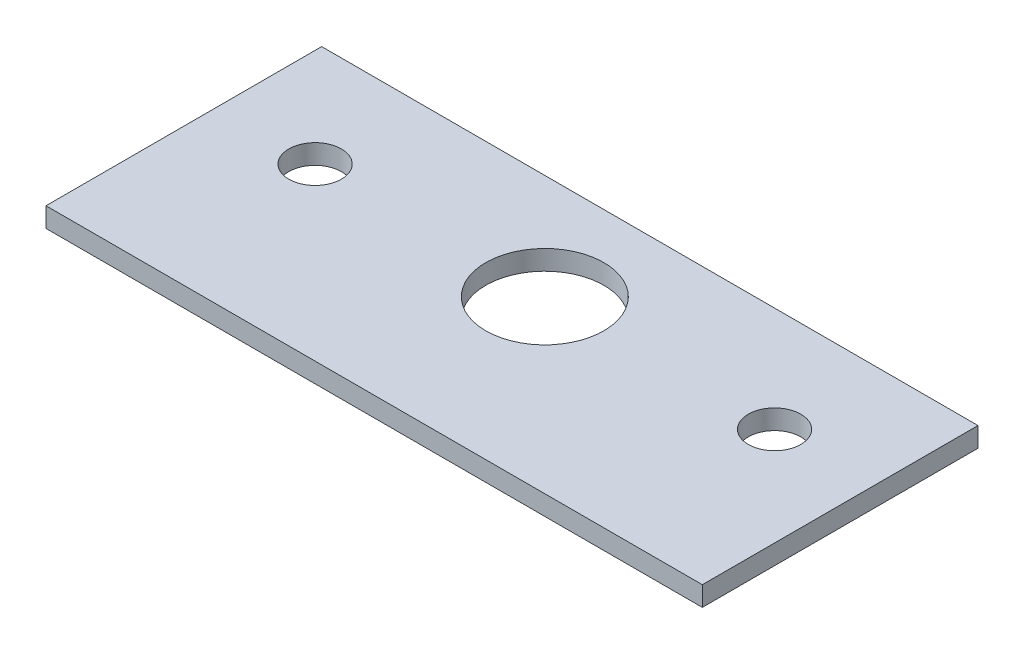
ISO-10303-21;
HEADER;
FILE_DESCRIPTION(('STEP AP214'),'2;1');
FILE_NAME('part.step','',(''),(''),'','','');
FILE_SCHEMA(('AUTOMOTIVE_DESIGN { 1 0 10303 214 1 1 1 1 }'));
ENDSEC;
DATA;
#1=APPLICATION_CONTEXT('core data for automotive mechanical design processes');
#2=APPLICATION_PROTOCOL_DEFINITION('international standard','automotive_design',2000,#1);
#3=PRODUCT_CONTEXT('',#1,'mechanical');
#4=PRODUCT('Part','Part','',(#3));
#5=PRODUCT_RELATED_PRODUCT_CATEGORY('part','',(#4));
#6=PRODUCT_DEFINITION_FORMATION('','',#4);
#7=PRODUCT_DEFINITION_CONTEXT('part definition',#1,'design');
#8=PRODUCT_DEFINITION('design','',#6,#7);
#9=PRODUCT_DEFINITION_SHAPE('','',#8);
#10=(LENGTH_UNIT() NAMED_UNIT(*) SI_UNIT(.MILLI.,.METRE.));
#11=(NAMED_UNIT(*) PLANE_ANGLE_UNIT() SI_UNIT($,.RADIAN.));
#12=(NAMED_UNIT(*) SI_UNIT($,.STERADIAN.) SOLID_ANGLE_UNIT());
#13=UNCERTAINTY_MEASURE_WITH_UNIT(LENGTH_MEASURE(1.E-05),#10,'distance_accuracy_value','');
#14=(GEOMETRIC_REPRESENTATION_CONTEXT(3) GLOBAL_UNCERTAINTY_ASSIGNED_CONTEXT((#13)) GLOBAL_UNIT_ASSIGNED_CONTEXT((#10,
#11,#12)) REPRESENTATION_CONTEXT('',''));
#15=CARTESIAN_POINT('',(0.,0.,0.));
#16=DIRECTION('',(0.,0.,1.));
#17=DIRECTION('',(1.,0.,0.));
#18=AXIS2_PLACEMENT_3D('',#15,#16,#17);
#19=CARTESIAN_POINT('',(50.,3.,21.));
#20=DIRECTION('',(0.,1.,0.));
#21=DIRECTION('',(0.,0.,1.));
#22=AXIS2_PLACEMENT_3D('',#19,#20,#21);
#23=PLANE('',#22);
#24=CARTESIAN_POINT('',(35.,3.,-4.99999999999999));
#25=DIRECTION('',(0.,1.,0.));
#26=DIRECTION('',(0.,0.,1.));
#27=AXIS2_PLACEMENT_3D('',#24,#25,#26);
#28=CIRCLE('',#27,4.00000000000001);
#29=CARTESIAN_POINT('',(35.,3.,-0.999999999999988));
#30=VERTEX_POINT('',#29);
#31=EDGE_CURVE('E119',#30,#30,#28,.T.);
#32=ORIENTED_EDGE('',*,*,#31,.F.);
#33=EDGE_LOOP('',(#32));
#34=FACE_BOUND('',#33,.T.);
#35=DIRECTION('',(0.,0.,-1.));
#36=VECTOR('',#35,1.);
#37=CARTESIAN_POINT('',(50.,3.,-21.));
#38=LINE('',#37,#36);
#39=CARTESIAN_POINT('',(50.,3.,21.));
#40=VERTEX_POINT('',#39);
#41=CARTESIAN_POINT('',(50.,3.,-21.));
#42=VERTEX_POINT('',#41);
#43=EDGE_CURVE('E89',#40,#42,#38,.T.);
#44=ORIENTED_EDGE('',*,*,#43,.T.);
#45=DIRECTION('',(-1.,0.,0.));
#46=VECTOR('',#45,1.);
#47=CARTESIAN_POINT('',(-50.,3.,-21.));
#48=LINE('',#47,#46);
#49=CARTESIAN_POINT('',(-50.,3.,-21.));
#50=VERTEX_POINT('',#49);
#51=EDGE_CURVE('E84',#42,#50,#48,.T.);
#52=ORIENTED_EDGE('',*,*,#51,.T.);
#53=DIRECTION('',(0.,0.,1.));
#54=VECTOR('',#53,1.);
#55=CARTESIAN_POINT('',(-50.,3.,-21.));
#56=LINE('',#55,#54);
#57=CARTESIAN_POINT('',(-50.,3.,21.));
#58=VERTEX_POINT('',#57);
#59=EDGE_CURVE('E87',#50,#58,#56,.T.);
#60=ORIENTED_EDGE('',*,*,#59,.T.);
#61=DIRECTION('',(1.,0.,0.));
#62=VECTOR('',#61,1.);
#63=CARTESIAN_POINT('',(-50.,3.,21.));
#64=LINE('',#63,#62);
#65=EDGE_CURVE('E54',#58,#40,#64,.T.);
#66=ORIENTED_EDGE('',*,*,#65,.T.);
#67=EDGE_LOOP('',(#44,#52,#60,#66));
#68=FACE_BOUND('',#67,.T.);
#69=CARTESIAN_POINT('',(0.,3.,-4.99999999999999));
#70=DIRECTION('',(0.,1.,0.));
#71=DIRECTION('',(0.,0.,1.));
#72=AXIS2_PLACEMENT_3D('',#69,#70,#71);
#73=CIRCLE('',#72,9.);
#74=CARTESIAN_POINT('',(0.,3.,4.00000000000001));
#75=VERTEX_POINT('',#74);
#76=EDGE_CURVE('E104',#75,#75,#73,.T.);
#77=ORIENTED_EDGE('',*,*,#76,.F.);
#78=EDGE_LOOP('',(#77));
#79=FACE_BOUND('',#78,.T.);
#80=CARTESIAN_POINT('',(-35.,3.,-4.99999999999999));
#81=DIRECTION('',(0.,1.,0.));
#82=DIRECTION('',(0.,0.,1.));
#83=AXIS2_PLACEMENT_3D('',#80,#81,#82);
#84=CIRCLE('',#83,4.);
#85=CARTESIAN_POINT('',(-35.,3.,-0.999999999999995));
#86=VERTEX_POINT('',#85);
#87=EDGE_CURVE('E125',#86,#86,#84,.T.);
#88=ORIENTED_EDGE('',*,*,#87,.F.);
#89=EDGE_LOOP('',(#88));
#90=FACE_BOUND('',#89,.T.);
#91=ADVANCED_FACE('F37',(#34,#68,#79,#90),#23,.T.);
#92=CARTESIAN_POINT('',(50.,0.,21.));
#93=DIRECTION('',(0.,1.,0.));
#94=DIRECTION('',(0.,0.,1.));
#95=AXIS2_PLACEMENT_3D('',#92,#93,#94);
#96=PLANE('',#95);
#97=CARTESIAN_POINT('',(35.,0.,-4.99999999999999));
#98=DIRECTION('',(0.,1.,0.));
#99=DIRECTION('',(0.,0.,1.));
#100=AXIS2_PLACEMENT_3D('',#97,#98,#99);
#101=CIRCLE('',#100,4.00000000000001);
#102=CARTESIAN_POINT('',(35.,0.,-0.999999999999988));
#103=VERTEX_POINT('',#102);
#104=EDGE_CURVE('E122',#103,#103,#101,.T.);
#105=ORIENTED_EDGE('',*,*,#104,.T.);
#106=EDGE_LOOP('',(#105));
#107=FACE_BOUND('',#106,.T.);
#108=DIRECTION('',(0.,0.,-1.));
#109=VECTOR('',#108,1.);
#110=CARTESIAN_POINT('',(50.,0.,-21.));
#111=LINE('',#110,#109);
#112=CARTESIAN_POINT('',(50.,0.,21.));
#113=VERTEX_POINT('',#112);
#114=CARTESIAN_POINT('',(50.,0.,-21.));
#115=VERTEX_POINT('',#114);
#116=EDGE_CURVE('E101',#113,#115,#111,.T.);
#117=ORIENTED_EDGE('',*,*,#116,.F.);
#118=DIRECTION('',(1.,0.,0.));
#119=VECTOR('',#118,1.);
#120=CARTESIAN_POINT('',(-50.,0.,21.));
#121=LINE('',#120,#119);
#122=CARTESIAN_POINT('',(-50.,0.,21.));
#123=VERTEX_POINT('',#122);
#124=EDGE_CURVE('E77',#123,#113,#121,.T.);
#125=ORIENTED_EDGE('',*,*,#124,.F.);
#126=DIRECTION('',(0.,0.,1.));
#127=VECTOR('',#126,1.);
#128=CARTESIAN_POINT('',(-50.,0.,-21.));
#129=LINE('',#128,#127);
#130=CARTESIAN_POINT('',(-50.,0.,-21.));
#131=VERTEX_POINT('',#130);
#132=EDGE_CURVE('E71',#131,#123,#129,.T.);
#133=ORIENTED_EDGE('',*,*,#132,.F.);
#134=DIRECTION('',(-1.,0.,0.));
#135=VECTOR('',#134,1.);
#136=CARTESIAN_POINT('',(-50.,0.,-21.));
#137=LINE('',#136,#135);
#138=EDGE_CURVE('E93',#115,#131,#137,.T.);
#139=ORIENTED_EDGE('',*,*,#138,.F.);
#140=EDGE_LOOP('',(#117,#125,#133,#139));
#141=FACE_BOUND('',#140,.T.);
#142=CARTESIAN_POINT('',(0.,0.,-4.99999999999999));
#143=DIRECTION('',(0.,1.,0.));
#144=DIRECTION('',(0.,0.,1.));
#145=AXIS2_PLACEMENT_3D('',#142,#143,#144);
#146=CIRCLE('',#145,9.);
#147=CARTESIAN_POINT('',(0.,0.,4.00000000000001));
#148=VERTEX_POINT('',#147);
#149=EDGE_CURVE('E116',#148,#148,#146,.T.);
#150=ORIENTED_EDGE('',*,*,#149,.T.);
#151=EDGE_LOOP('',(#150));
#152=FACE_BOUND('',#151,.T.);
#153=CARTESIAN_POINT('',(-35.,0.,-4.99999999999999));
#154=DIRECTION('',(0.,1.,0.));
#155=DIRECTION('',(0.,0.,1.));
#156=AXIS2_PLACEMENT_3D('',#153,#154,#155);
#157=CIRCLE('',#156,4.);
#158=CARTESIAN_POINT('',(-35.,0.,-0.999999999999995));
#159=VERTEX_POINT('',#158);
#160=EDGE_CURVE('E128',#159,#159,#157,.T.);
#161=ORIENTED_EDGE('',*,*,#160,.T.);
#162=EDGE_LOOP('',(#161));
#163=FACE_BOUND('',#162,.T.);
#164=ADVANCED_FACE('F112',(#107,#141,#152,#163),#96,.F.);
#165=CARTESIAN_POINT('',(50.,3.,-21.));
#166=DIRECTION('',(-1.,0.,0.));
#167=DIRECTION('',(0.,0.,1.));
#168=AXIS2_PLACEMENT_3D('',#165,#166,#167);
#169=PLANE('',#168);
#170=ORIENTED_EDGE('',*,*,#116,.T.);
#171=DIRECTION('',(0.,-1.,0.));
#172=VECTOR('',#171,1.);
#173=CARTESIAN_POINT('',(50.,3.,-21.));
#174=LINE('',#173,#172);
#175=EDGE_CURVE('E11',#42,#115,#174,.T.);
#176=ORIENTED_EDGE('',*,*,#175,.F.);
#177=ORIENTED_EDGE('',*,*,#43,.F.);
#178=DIRECTION('',(0.,-1.,0.));
#179=VECTOR('',#178,1.);
#180=CARTESIAN_POINT('',(50.,3.,21.));
#181=LINE('',#180,#179);
#182=EDGE_CURVE('E97',#40,#113,#181,.T.);
#183=ORIENTED_EDGE('',*,*,#182,.T.);
#184=EDGE_LOOP('',(#170,#176,#177,#183));
#185=FACE_BOUND('',#184,.T.);
#186=ADVANCED_FACE('F39',(#185),#169,.F.);
#187=CARTESIAN_POINT('',(-50.,3.,-21.));
#188=DIRECTION('',(0.,0.,1.));
#189=DIRECTION('',(1.,0.,0.));
#190=AXIS2_PLACEMENT_3D('',#187,#188,#189);
#191=PLANE('',#190);
#192=ORIENTED_EDGE('',*,*,#138,.T.);
#193=DIRECTION('',(0.,-1.,0.));
#194=VECTOR('',#193,1.);
#195=CARTESIAN_POINT('',(-50.,3.,-21.));
#196=LINE('',#195,#194);
#197=EDGE_CURVE('E46',#50,#131,#196,.T.);
#198=ORIENTED_EDGE('',*,*,#197,.F.);
#199=ORIENTED_EDGE('',*,*,#51,.F.);
#200=ORIENTED_EDGE('',*,*,#175,.T.);
#201=EDGE_LOOP('',(#192,#198,#199,#200));
#202=FACE_BOUND('',#201,.T.);
#203=ADVANCED_FACE('F92',(#202),#191,.F.);
#204=CARTESIAN_POINT('',(-50.,3.,-21.));
#205=DIRECTION('',(1.,0.,0.));
#206=DIRECTION('',(0.,0.,-1.));
#207=AXIS2_PLACEMENT_3D('',#204,#205,#206);
#208=PLANE('',#207);
#209=ORIENTED_EDGE('',*,*,#132,.T.);
#210=DIRECTION('',(0.,-1.,0.));
#211=VECTOR('',#210,1.);
#212=CARTESIAN_POINT('',(-50.,3.,21.));
#213=LINE('',#212,#211);
#214=EDGE_CURVE('E94',#58,#123,#213,.T.);
#215=ORIENTED_EDGE('',*,*,#214,.F.);
#216=ORIENTED_EDGE('',*,*,#59,.F.);
#217=ORIENTED_EDGE('',*,*,#197,.T.);
#218=EDGE_LOOP('',(#209,#215,#216,#217));
#219=FACE_BOUND('',#218,.T.);
#220=ADVANCED_FACE('F95',(#219),#208,.F.);
#221=CARTESIAN_POINT('',(-50.,3.,21.));
#222=DIRECTION('',(0.,0.,-1.));
#223=DIRECTION('',(-1.,0.,0.));
#224=AXIS2_PLACEMENT_3D('',#221,#222,#223);
#225=PLANE('',#224);
#226=ORIENTED_EDGE('',*,*,#124,.T.);
#227=ORIENTED_EDGE('',*,*,#182,.F.);
#228=ORIENTED_EDGE('',*,*,#65,.F.);
#229=ORIENTED_EDGE('',*,*,#214,.T.);
#230=EDGE_LOOP('',(#226,#227,#228,#229));
#231=FACE_BOUND('',#230,.T.);
#232=ADVANCED_FACE('F109',(#231),#225,.F.);
#233=CARTESIAN_POINT('',(0.,3.,-4.99999999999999));
#234=DIRECTION('',(0.,-1.,0.));
#235=DIRECTION('',(0.,0.,-1.));
#236=AXIS2_PLACEMENT_3D('',#233,#234,#235);
#237=CYLINDRICAL_SURFACE('',#236,9.);
#238=ORIENTED_EDGE('',*,*,#76,.T.);
#239=EDGE_LOOP('',(#238));
#240=FACE_BOUND('',#239,.T.);
#241=ORIENTED_EDGE('',*,*,#149,.F.);
#242=EDGE_LOOP('',(#241));
#243=FACE_BOUND('',#242,.T.);
#244=ADVANCED_FACE('F147',(#240,#243),#237,.F.);
#245=CARTESIAN_POINT('',(35.,3.,-4.99999999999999));
#246=DIRECTION('',(0.,-1.,0.));
#247=DIRECTION('',(0.,0.,-1.));
#248=AXIS2_PLACEMENT_3D('',#245,#246,#247);
#249=CYLINDRICAL_SURFACE('',#248,4.00000000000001);
#250=ORIENTED_EDGE('',*,*,#31,.T.);
#251=EDGE_LOOP('',(#250));
#252=FACE_BOUND('',#251,.T.);
#253=ORIENTED_EDGE('',*,*,#104,.F.);
#254=EDGE_LOOP('',(#253));
#255=FACE_BOUND('',#254,.T.);
#256=ADVANCED_FACE('F193',(#252,#255),#249,.F.);
#257=CARTESIAN_POINT('',(-35.,3.,-4.99999999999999));
#258=DIRECTION('',(0.,-1.,0.));
#259=DIRECTION('',(0.,0.,-1.));
#260=AXIS2_PLACEMENT_3D('',#257,#258,#259);
#261=CYLINDRICAL_SURFACE('',#260,4.);
#262=ORIENTED_EDGE('',*,*,#87,.T.);
#263=EDGE_LOOP('',(#262));
#264=FACE_BOUND('',#263,.T.);
#265=ORIENTED_EDGE('',*,*,#160,.F.);
#266=EDGE_LOOP('',(#265));
#267=FACE_BOUND('',#266,.T.);
#268=ADVANCED_FACE('F134',(#264,#267),#261,.F.);
#269=CLOSED_SHELL('',(#91,#164,#186,#203,#220,#232,#244,#256,#268));
#270=MANIFOLD_SOLID_BREP('B2',#269);
#271=ADVANCED_BREP_SHAPE_REPRESENTATION('',(#18,#270),#14);
#272=SHAPE_DEFINITION_REPRESENTATION(#9,#271);
ENDSEC;
END-ISO-10303-21;
